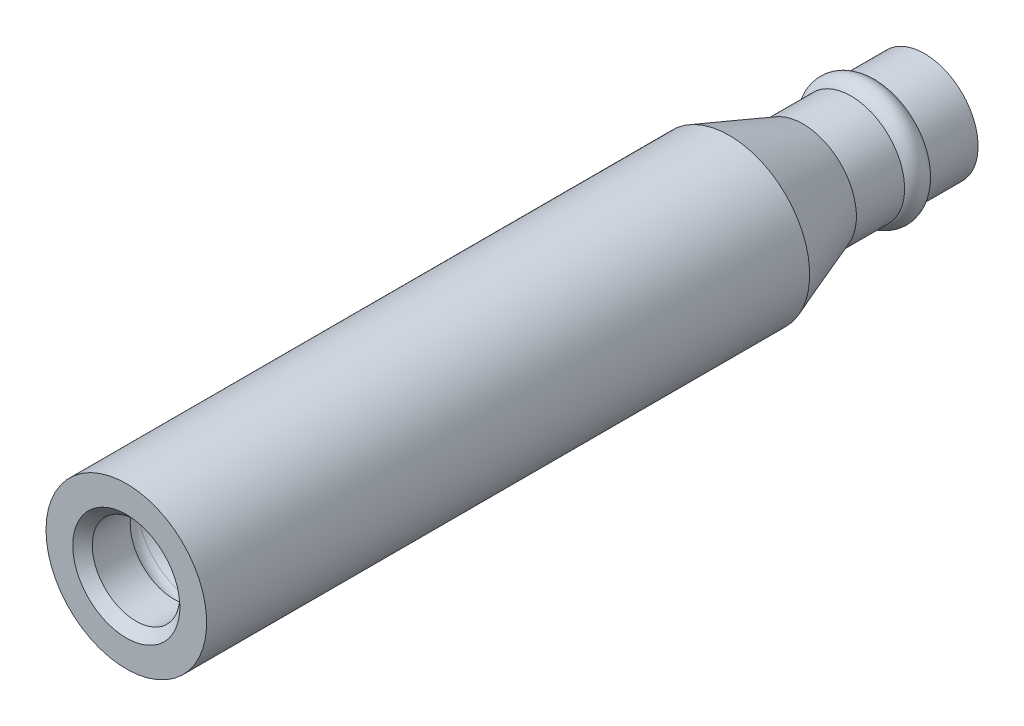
from build123d import *


with BuildPart() as part:
    # Sketch1 → Revolve1 (revolve)
    with BuildSketch(Plane(origin=(0, 0, 0), x_dir=(0, 0, -1), z_dir=(1, 0, 0)), mode=Mode.PRIVATE) as revolve1_sk:
        with BuildLine():
            Line((-20.828, 2.794), (-20.828, 4.191))
            Line((-20.828, 4.191), (10.639774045, 4.191))
            Line((10.639774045, 4.191), (14.478, 2.794))
            Line((14.478, 2.794), (16.993088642, 2.794))
            ThreePointArc((16.993088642, 2.794), (17.653, 3.175), (18.312911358, 2.794))
            Line((18.312911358, 2.794), (20.828, 2.794))
            Line((20.828, 2.794), (20.828, 0.635))
            Line((20.828, 0.635), (8.128, 0.635))
            Line((8.128, 0.635), (8.128, 1.7526))
            Line((8.128, 1.7526), (2.032, 1.7526))
            Line((2.032, 1.7526), (2.032, 2.6924))
            Line((2.032, 2.6924), (-12.446, 2.6924))
            Line((-12.446, 2.6924), (-12.446, 2.286))
            Line((-12.446, 2.286), (-15.773754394, 2.286))
            Line((-15.773754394, 2.286), (-17.254764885, 2.976606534))
            ThreePointArc((-17.254764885, 2.976606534), (-17.986222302, 2.928664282), (-18.3388, 2.286))
            Line((-18.3388, 2.286), (-20.32, 2.286))
            Line((-20.32, 2.286), (-20.828, 2.794))
        make_face()
    revolve(revolve1_sk.sketch.rotate(Axis((0, 0, -16.129), (0, 0, 1)), 90), axis=Axis((0, 0, -16.129), (0, 0, 1)))


solid = part.part
